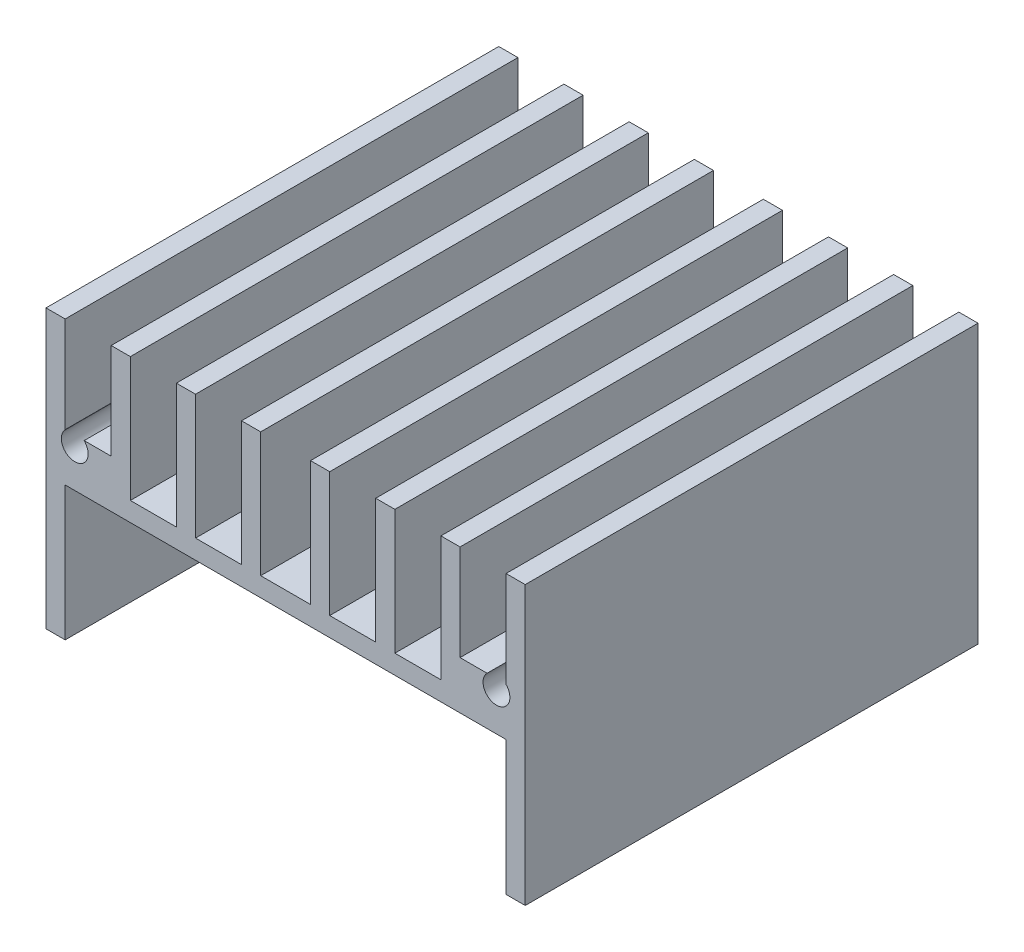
ISO-10303-21;
HEADER;
FILE_DESCRIPTION(('STEP AP214'),'2;1');
FILE_NAME('part.step','',(''),(''),'','','');
FILE_SCHEMA(('AUTOMOTIVE_DESIGN { 1 0 10303 214 1 1 1 1 }'));
ENDSEC;
DATA;
#1=APPLICATION_CONTEXT('core data for automotive mechanical design processes');
#2=APPLICATION_PROTOCOL_DEFINITION('international standard','automotive_design',2000,#1);
#3=PRODUCT_CONTEXT('',#1,'mechanical');
#4=PRODUCT('Part','Part','',(#3));
#5=PRODUCT_RELATED_PRODUCT_CATEGORY('part','',(#4));
#6=PRODUCT_DEFINITION_FORMATION('','',#4);
#7=PRODUCT_DEFINITION_CONTEXT('part definition',#1,'design');
#8=PRODUCT_DEFINITION('design','',#6,#7);
#9=PRODUCT_DEFINITION_SHAPE('','',#8);
#10=(LENGTH_UNIT() NAMED_UNIT(*) SI_UNIT(.MILLI.,.METRE.));
#11=(NAMED_UNIT(*) PLANE_ANGLE_UNIT() SI_UNIT($,.RADIAN.));
#12=(NAMED_UNIT(*) SI_UNIT($,.STERADIAN.) SOLID_ANGLE_UNIT());
#13=UNCERTAINTY_MEASURE_WITH_UNIT(LENGTH_MEASURE(1.E-05),#10,'distance_accuracy_value','');
#14=(GEOMETRIC_REPRESENTATION_CONTEXT(3) GLOBAL_UNCERTAINTY_ASSIGNED_CONTEXT((#13)) GLOBAL_UNIT_ASSIGNED_CONTEXT((#10,
#11,#12)) REPRESENTATION_CONTEXT('',''));
#15=CARTESIAN_POINT('',(0.,0.,0.));
#16=DIRECTION('',(0.,0.,1.));
#17=DIRECTION('',(1.,0.,0.));
#18=AXIS2_PLACEMENT_3D('',#15,#16,#17);
#19=CARTESIAN_POINT('',(11.557,0.635,29.9974));
#20=DIRECTION('',(0.,1.,0.));
#21=DIRECTION('',(0.,0.,1.));
#22=AXIS2_PLACEMENT_3D('',#19,#20,#21);
#23=PLANE('',#22);
#24=DIRECTION('',(0.,0.,-1.));
#25=VECTOR('',#24,1.);
#26=CARTESIAN_POINT('',(14.5921703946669,0.635,32.5118717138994));
#27=LINE('',#26,#25);
#28=CARTESIAN_POINT('',(14.5921703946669,0.635,29.9974));
#29=VERTEX_POINT('',#28);
#30=CARTESIAN_POINT('',(14.5921703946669,0.635,0.));
#31=VERTEX_POINT('',#30);
#32=EDGE_CURVE('E11',#29,#31,#27,.T.);
#33=ORIENTED_EDGE('',*,*,#32,.F.);
#34=DIRECTION('',(1.,0.,0.));
#35=VECTOR('',#34,1.);
#36=CARTESIAN_POINT('',(11.557,0.635,29.9974));
#37=LINE('',#36,#35);
#38=CARTESIAN_POINT('',(14.605,0.635,29.9974));
#39=VERTEX_POINT('',#38);
#40=EDGE_CURVE('E307',#29,#39,#37,.T.);
#41=ORIENTED_EDGE('',*,*,#40,.T.);
#42=DIRECTION('',(0.,0.,-1.));
#43=VECTOR('',#42,1.);
#44=CARTESIAN_POINT('',(14.605,0.635,0.));
#45=LINE('',#44,#43);
#46=CARTESIAN_POINT('',(14.605,0.635,0.));
#47=VERTEX_POINT('',#46);
#48=EDGE_CURVE('E318',#39,#47,#45,.T.);
#49=ORIENTED_EDGE('',*,*,#48,.T.);
#50=DIRECTION('',(-1.,0.,0.));
#51=VECTOR('',#50,1.);
#52=CARTESIAN_POINT('',(11.557,0.635,0.));
#53=LINE('',#52,#51);
#54=EDGE_CURVE('E310',#47,#31,#53,.T.);
#55=ORIENTED_EDGE('',*,*,#54,.T.);
#56=EDGE_LOOP('',(#33,#41,#49,#55));
#57=FACE_BOUND('',#56,.T.);
#58=ADVANCED_FACE('F30',(#57),#23,.T.);
#59=CARTESIAN_POINT('',(-14.605,0.635,29.9974));
#60=DIRECTION('',(0.,1.,0.));
#61=DIRECTION('',(0.,0.,1.));
#62=AXIS2_PLACEMENT_3D('',#59,#60,#61);
#63=PLANE('',#62);
#64=DIRECTION('',(0.,0.,-1.));
#65=VECTOR('',#64,1.);
#66=CARTESIAN_POINT('',(-13.3478296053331,0.635,32.5118717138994));
#67=LINE('',#66,#65);
#68=CARTESIAN_POINT('',(-13.3478296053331,0.635,29.9974));
#69=VERTEX_POINT('',#68);
#70=CARTESIAN_POINT('',(-13.3478296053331,0.635,0.));
#71=VERTEX_POINT('',#70);
#72=EDGE_CURVE('E586',#69,#71,#67,.T.);
#73=ORIENTED_EDGE('',*,*,#72,.F.);
#74=DIRECTION('',(1.,0.,0.));
#75=VECTOR('',#74,1.);
#76=CARTESIAN_POINT('',(-14.605,0.635,29.9974));
#77=LINE('',#76,#75);
#78=CARTESIAN_POINT('',(-11.557,0.635,29.9974));
#79=VERTEX_POINT('',#78);
#80=EDGE_CURVE('E330',#69,#79,#77,.T.);
#81=ORIENTED_EDGE('',*,*,#80,.T.);
#82=DIRECTION('',(0.,0.,-1.));
#83=VECTOR('',#82,1.);
#84=CARTESIAN_POINT('',(-11.557,0.635,0.));
#85=LINE('',#84,#83);
#86=CARTESIAN_POINT('',(-11.557,0.635,0.));
#87=VERTEX_POINT('',#86);
#88=EDGE_CURVE('E334',#79,#87,#85,.T.);
#89=ORIENTED_EDGE('',*,*,#88,.T.);
#90=DIRECTION('',(-1.,0.,0.));
#91=VECTOR('',#90,1.);
#92=CARTESIAN_POINT('',(-14.605,0.635,0.));
#93=LINE('',#92,#91);
#94=EDGE_CURVE('E338',#87,#71,#93,.T.);
#95=ORIENTED_EDGE('',*,*,#94,.T.);
#96=EDGE_LOOP('',(#73,#81,#89,#95));
#97=FACE_BOUND('',#96,.T.);
#98=ADVANCED_FACE('F600',(#97),#63,.T.);
#99=CARTESIAN_POINT('',(-14.605,-11.43,29.9974));
#100=DIRECTION('',(0.,1.,0.));
#101=DIRECTION('',(0.,0.,1.));
#102=AXIS2_PLACEMENT_3D('',#99,#100,#101);
#103=PLANE('',#102);
#104=DIRECTION('',(1.,0.,0.));
#105=VECTOR('',#104,1.);
#106=CARTESIAN_POINT('',(-14.605,-11.43,0.));
#107=LINE('',#106,#105);
#108=CARTESIAN_POINT('',(-15.875,-11.43,0.));
#109=VERTEX_POINT('',#108);
#110=CARTESIAN_POINT('',(-14.605,-11.43,0.));
#111=VERTEX_POINT('',#110);
#112=EDGE_CURVE('E341',#109,#111,#107,.T.);
#113=ORIENTED_EDGE('',*,*,#112,.T.);
#114=DIRECTION('',(0.,0.,-1.));
#115=VECTOR('',#114,1.);
#116=CARTESIAN_POINT('',(-14.605,-11.43,29.9974));
#117=LINE('',#116,#115);
#118=CARTESIAN_POINT('',(-14.605,-11.43,29.9974));
#119=VERTEX_POINT('',#118);
#120=EDGE_CURVE('E578',#119,#111,#117,.T.);
#121=ORIENTED_EDGE('',*,*,#120,.F.);
#122=DIRECTION('',(1.,0.,0.));
#123=VECTOR('',#122,1.);
#124=CARTESIAN_POINT('',(-14.605,-11.43,29.9974));
#125=LINE('',#124,#123);
#126=CARTESIAN_POINT('',(-15.875,-11.43,29.9974));
#127=VERTEX_POINT('',#126);
#128=EDGE_CURVE('E342',#127,#119,#125,.T.);
#129=ORIENTED_EDGE('',*,*,#128,.F.);
#130=DIRECTION('',(0.,0.,-1.));
#131=VECTOR('',#130,1.);
#132=CARTESIAN_POINT('',(-15.875,-11.43,29.9974));
#133=LINE('',#132,#131);
#134=EDGE_CURVE('E412',#127,#109,#133,.T.);
#135=ORIENTED_EDGE('',*,*,#134,.T.);
#136=EDGE_LOOP('',(#113,#121,#129,#135));
#137=FACE_BOUND('',#136,.T.);
#138=ADVANCED_FACE('F32',(#137),#103,.F.);
#139=CARTESIAN_POINT('',(-14.605,-2.54,29.9974));
#140=DIRECTION('',(-1.,0.,0.));
#141=DIRECTION('',(0.,0.,1.));
#142=AXIS2_PLACEMENT_3D('',#139,#140,#141);
#143=PLANE('',#142);
#144=DIRECTION('',(0.,1.,0.));
#145=VECTOR('',#144,1.);
#146=CARTESIAN_POINT('',(-14.605,-2.54,0.));
#147=LINE('',#146,#145);
#148=CARTESIAN_POINT('',(-14.605,-2.54,0.));
#149=VERTEX_POINT('',#148);
#150=EDGE_CURVE('E415',#111,#149,#147,.T.);
#151=ORIENTED_EDGE('',*,*,#150,.T.);
#152=DIRECTION('',(0.,0.,-1.));
#153=VECTOR('',#152,1.);
#154=CARTESIAN_POINT('',(-14.605,-2.54,29.9974));
#155=LINE('',#154,#153);
#156=CARTESIAN_POINT('',(-14.605,-2.54,29.9974));
#157=VERTEX_POINT('',#156);
#158=EDGE_CURVE('E575',#157,#149,#155,.T.);
#159=ORIENTED_EDGE('',*,*,#158,.F.);
#160=DIRECTION('',(0.,1.,0.));
#161=VECTOR('',#160,1.);
#162=CARTESIAN_POINT('',(-14.605,-2.54,29.9974));
#163=LINE('',#162,#161);
#164=EDGE_CURVE('E345',#119,#157,#163,.T.);
#165=ORIENTED_EDGE('',*,*,#164,.F.);
#166=ORIENTED_EDGE('',*,*,#120,.T.);
#167=EDGE_LOOP('',(#151,#159,#165,#166));
#168=FACE_BOUND('',#167,.T.);
#169=ADVANCED_FACE('F754',(#168),#143,.F.);
#170=CARTESIAN_POINT('',(14.605,-2.54,29.9974));
#171=DIRECTION('',(0.,1.,0.));
#172=DIRECTION('',(0.,0.,1.));
#173=AXIS2_PLACEMENT_3D('',#170,#171,#172);
#174=PLANE('',#173);
#175=CARTESIAN_POINT('',(8.89,-2.54,19.9898));
#176=DIRECTION('',(0.,-1.,0.));
#177=DIRECTION('',(0.,0.,-1.));
#178=AXIS2_PLACEMENT_3D('',#175,#176,#177);
#179=CIRCLE('',#178,1.4986);
#180=CARTESIAN_POINT('',(8.89,-2.54,18.4912));
#181=VERTEX_POINT('',#180);
#182=EDGE_CURVE('E732',#181,#181,#179,.T.);
#183=ORIENTED_EDGE('',*,*,#182,.F.);
#184=EDGE_LOOP('',(#183));
#185=FACE_BOUND('',#184,.T.);
#186=CARTESIAN_POINT('',(-8.89,-2.54,19.9898));
#187=DIRECTION('',(0.,-1.,0.));
#188=DIRECTION('',(0.,0.,-1.));
#189=AXIS2_PLACEMENT_3D('',#186,#187,#188);
#190=CIRCLE('',#189,1.4986);
#191=CARTESIAN_POINT('',(-8.89,-2.54,18.4912));
#192=VERTEX_POINT('',#191);
#193=EDGE_CURVE('E731',#192,#192,#190,.T.);
#194=ORIENTED_EDGE('',*,*,#193,.F.);
#195=EDGE_LOOP('',(#194));
#196=FACE_BOUND('',#195,.T.);
#197=DIRECTION('',(1.,0.,0.));
#198=VECTOR('',#197,1.);
#199=CARTESIAN_POINT('',(14.605,-2.54,0.));
#200=LINE('',#199,#198);
#201=CARTESIAN_POINT('',(14.605,-2.54,0.));
#202=VERTEX_POINT('',#201);
#203=EDGE_CURVE('E417',#149,#202,#200,.T.);
#204=ORIENTED_EDGE('',*,*,#203,.T.);
#205=DIRECTION('',(0.,0.,-1.));
#206=VECTOR('',#205,1.);
#207=CARTESIAN_POINT('',(14.605,-2.54,29.9974));
#208=LINE('',#207,#206);
#209=CARTESIAN_POINT('',(14.605,-2.54,29.9974));
#210=VERTEX_POINT('',#209);
#211=EDGE_CURVE('E572',#210,#202,#208,.T.);
#212=ORIENTED_EDGE('',*,*,#211,.F.);
#213=DIRECTION('',(1.,0.,0.));
#214=VECTOR('',#213,1.);
#215=CARTESIAN_POINT('',(14.605,-2.54,29.9974));
#216=LINE('',#215,#214);
#217=EDGE_CURVE('E348',#157,#210,#216,.T.);
#218=ORIENTED_EDGE('',*,*,#217,.F.);
#219=ORIENTED_EDGE('',*,*,#158,.T.);
#220=EDGE_LOOP('',(#204,#212,#218,#219));
#221=FACE_BOUND('',#220,.T.);
#222=ADVANCED_FACE('F750',(#185,#196,#221),#174,.F.);
#223=CARTESIAN_POINT('',(14.605,-11.43,29.9974));
#224=DIRECTION('',(1.,0.,0.));
#225=DIRECTION('',(0.,0.,-1.));
#226=AXIS2_PLACEMENT_3D('',#223,#224,#225);
#227=PLANE('',#226);
#228=DIRECTION('',(0.,-1.,0.));
#229=VECTOR('',#228,1.);
#230=CARTESIAN_POINT('',(14.605,-11.43,0.));
#231=LINE('',#230,#229);
#232=CARTESIAN_POINT('',(14.605,-11.43,0.));
#233=VERTEX_POINT('',#232);
#234=EDGE_CURVE('E419',#202,#233,#231,.T.);
#235=ORIENTED_EDGE('',*,*,#234,.T.);
#236=DIRECTION('',(0.,0.,-1.));
#237=VECTOR('',#236,1.);
#238=CARTESIAN_POINT('',(14.605,-11.43,29.9974));
#239=LINE('',#238,#237);
#240=CARTESIAN_POINT('',(14.605,-11.43,29.9974));
#241=VERTEX_POINT('',#240);
#242=EDGE_CURVE('E569',#241,#233,#239,.T.);
#243=ORIENTED_EDGE('',*,*,#242,.F.);
#244=DIRECTION('',(0.,-1.,0.));
#245=VECTOR('',#244,1.);
#246=CARTESIAN_POINT('',(14.605,-11.43,29.9974));
#247=LINE('',#246,#245);
#248=EDGE_CURVE('E350',#210,#241,#247,.T.);
#249=ORIENTED_EDGE('',*,*,#248,.F.);
#250=ORIENTED_EDGE('',*,*,#211,.T.);
#251=EDGE_LOOP('',(#235,#243,#249,#250));
#252=FACE_BOUND('',#251,.T.);
#253=ADVANCED_FACE('F753',(#252),#227,.F.);
#254=CARTESIAN_POINT('',(15.875,-11.43,29.9974));
#255=DIRECTION('',(0.,1.,0.));
#256=DIRECTION('',(0.,0.,1.));
#257=AXIS2_PLACEMENT_3D('',#254,#255,#256);
#258=PLANE('',#257);
#259=DIRECTION('',(1.,0.,0.));
#260=VECTOR('',#259,1.);
#261=CARTESIAN_POINT('',(15.875,-11.43,0.));
#262=LINE('',#261,#260);
#263=CARTESIAN_POINT('',(15.875,-11.43,0.));
#264=VERTEX_POINT('',#263);
#265=EDGE_CURVE('E421',#233,#264,#262,.T.);
#266=ORIENTED_EDGE('',*,*,#265,.T.);
#267=DIRECTION('',(0.,0.,-1.));
#268=VECTOR('',#267,1.);
#269=CARTESIAN_POINT('',(15.875,-11.43,29.9974));
#270=LINE('',#269,#268);
#271=CARTESIAN_POINT('',(15.875,-11.43,29.9974));
#272=VERTEX_POINT('',#271);
#273=EDGE_CURVE('E566',#272,#264,#270,.T.);
#274=ORIENTED_EDGE('',*,*,#273,.F.);
#275=DIRECTION('',(1.,0.,0.));
#276=VECTOR('',#275,1.);
#277=CARTESIAN_POINT('',(15.875,-11.43,29.9974));
#278=LINE('',#277,#276);
#279=EDGE_CURVE('E352',#241,#272,#278,.T.);
#280=ORIENTED_EDGE('',*,*,#279,.F.);
#281=ORIENTED_EDGE('',*,*,#242,.T.);
#282=EDGE_LOOP('',(#266,#274,#280,#281));
#283=FACE_BOUND('',#282,.T.);
#284=ADVANCED_FACE('F770',(#283),#258,.F.);
#285=CARTESIAN_POINT('',(15.875,6.985,29.9974));
#286=DIRECTION('',(-1.,0.,0.));
#287=DIRECTION('',(0.,0.,1.));
#288=AXIS2_PLACEMENT_3D('',#285,#286,#287);
#289=PLANE('',#288);
#290=DIRECTION('',(0.,1.,0.));
#291=VECTOR('',#290,1.);
#292=CARTESIAN_POINT('',(15.875,6.985,0.));
#293=LINE('',#292,#291);
#294=CARTESIAN_POINT('',(15.875,6.985,0.));
#295=VERTEX_POINT('',#294);
#296=EDGE_CURVE('E423',#264,#295,#293,.T.);
#297=ORIENTED_EDGE('',*,*,#296,.T.);
#298=DIRECTION('',(0.,0.,-1.));
#299=VECTOR('',#298,1.);
#300=CARTESIAN_POINT('',(15.875,6.985,29.9974));
#301=LINE('',#300,#299);
#302=CARTESIAN_POINT('',(15.875,6.985,29.9974));
#303=VERTEX_POINT('',#302);
#304=EDGE_CURVE('E563',#303,#295,#301,.T.);
#305=ORIENTED_EDGE('',*,*,#304,.F.);
#306=DIRECTION('',(0.,1.,0.));
#307=VECTOR('',#306,1.);
#308=CARTESIAN_POINT('',(15.875,6.985,29.9974));
#309=LINE('',#308,#307);
#310=EDGE_CURVE('E354',#272,#303,#309,.T.);
#311=ORIENTED_EDGE('',*,*,#310,.F.);
#312=ORIENTED_EDGE('',*,*,#273,.T.);
#313=EDGE_LOOP('',(#297,#305,#311,#312));
#314=FACE_BOUND('',#313,.T.);
#315=ADVANCED_FACE('F774',(#314),#289,.F.);
#316=CARTESIAN_POINT('',(14.605,6.985,29.9974));
#317=DIRECTION('',(0.,-1.,0.));
#318=DIRECTION('',(0.,0.,-1.));
#319=AXIS2_PLACEMENT_3D('',#316,#317,#318);
#320=PLANE('',#319);
#321=DIRECTION('',(-1.,0.,0.));
#322=VECTOR('',#321,1.);
#323=CARTESIAN_POINT('',(14.605,6.985,0.));
#324=LINE('',#323,#322);
#325=CARTESIAN_POINT('',(14.605,6.985,0.));
#326=VERTEX_POINT('',#325);
#327=EDGE_CURVE('E425',#295,#326,#324,.T.);
#328=ORIENTED_EDGE('',*,*,#327,.T.);
#329=DIRECTION('',(0.,0.,-1.));
#330=VECTOR('',#329,1.);
#331=CARTESIAN_POINT('',(14.605,6.985,29.9974));
#332=LINE('',#331,#330);
#333=CARTESIAN_POINT('',(14.605,6.985,29.9974));
#334=VERTEX_POINT('',#333);
#335=EDGE_CURVE('E560',#334,#326,#332,.T.);
#336=ORIENTED_EDGE('',*,*,#335,.F.);
#337=DIRECTION('',(-1.,0.,0.));
#338=VECTOR('',#337,1.);
#339=CARTESIAN_POINT('',(14.605,6.985,29.9974));
#340=LINE('',#339,#338);
#341=EDGE_CURVE('E356',#303,#334,#340,.T.);
#342=ORIENTED_EDGE('',*,*,#341,.F.);
#343=ORIENTED_EDGE('',*,*,#304,.T.);
#344=EDGE_LOOP('',(#328,#336,#342,#343));
#345=FACE_BOUND('',#344,.T.);
#346=ADVANCED_FACE('F922',(#345),#320,.F.);
#347=CARTESIAN_POINT('',(14.605,-1.27,29.9974));
#348=DIRECTION('',(1.,0.,0.));
#349=DIRECTION('',(0.,0.,-1.));
#350=AXIS2_PLACEMENT_3D('',#347,#348,#349);
#351=PLANE('',#350);
#352=DIRECTION('',(0.,-1.,0.));
#353=VECTOR('',#352,1.);
#354=CARTESIAN_POINT('',(14.605,-1.27,0.));
#355=LINE('',#354,#353);
#356=EDGE_CURVE('E427',#326,#47,#355,.T.);
#357=ORIENTED_EDGE('',*,*,#356,.T.);
#358=ORIENTED_EDGE('',*,*,#48,.F.);
#359=DIRECTION('',(0.,-1.,0.));
#360=VECTOR('',#359,1.);
#361=CARTESIAN_POINT('',(14.605,-1.27,29.9974));
#362=LINE('',#361,#360);
#363=EDGE_CURVE('E314',#334,#39,#362,.T.);
#364=ORIENTED_EDGE('',*,*,#363,.F.);
#365=ORIENTED_EDGE('',*,*,#335,.T.);
#366=EDGE_LOOP('',(#357,#358,#364,#365));
#367=FACE_BOUND('',#366,.T.);
#368=ADVANCED_FACE('F929',(#367),#351,.F.);
#369=CARTESIAN_POINT('',(11.557,6.985,29.9974));
#370=DIRECTION('',(-1.,0.,0.));
#371=DIRECTION('',(0.,0.,1.));
#372=AXIS2_PLACEMENT_3D('',#369,#370,#371);
#373=PLANE('',#372);
#374=DIRECTION('',(0.,1.,0.));
#375=VECTOR('',#374,1.);
#376=CARTESIAN_POINT('',(11.557,6.985,29.9974));
#377=LINE('',#376,#375);
#378=CARTESIAN_POINT('',(11.557,0.635,29.9974));
#379=VERTEX_POINT('',#378);
#380=CARTESIAN_POINT('',(11.557,6.985,29.9974));
#381=VERTEX_POINT('',#380);
#382=EDGE_CURVE('E359',#379,#381,#377,.T.);
#383=ORIENTED_EDGE('',*,*,#382,.F.);
#384=DIRECTION('',(0.,0.,1.));
#385=VECTOR('',#384,1.);
#386=CARTESIAN_POINT('',(11.557,0.635,0.));
#387=LINE('',#386,#385);
#388=CARTESIAN_POINT('',(11.557,0.635,0.));
#389=VERTEX_POINT('',#388);
#390=EDGE_CURVE('E316',#389,#379,#387,.T.);
#391=ORIENTED_EDGE('',*,*,#390,.F.);
#392=DIRECTION('',(0.,1.,0.));
#393=VECTOR('',#392,1.);
#394=CARTESIAN_POINT('',(11.557,6.985,0.));
#395=LINE('',#394,#393);
#396=CARTESIAN_POINT('',(11.557,6.985,0.));
#397=VERTEX_POINT('',#396);
#398=EDGE_CURVE('E429',#389,#397,#395,.T.);
#399=ORIENTED_EDGE('',*,*,#398,.T.);
#400=DIRECTION('',(0.,0.,-1.));
#401=VECTOR('',#400,1.);
#402=CARTESIAN_POINT('',(11.557,6.985,29.9974));
#403=LINE('',#402,#401);
#404=EDGE_CURVE('E557',#381,#397,#403,.T.);
#405=ORIENTED_EDGE('',*,*,#404,.F.);
#406=EDGE_LOOP('',(#383,#391,#399,#405));
#407=FACE_BOUND('',#406,.T.);
#408=ADVANCED_FACE('F718',(#407),#373,.F.);
#409=CARTESIAN_POINT('',(10.287,6.985,29.9974));
#410=DIRECTION('',(0.,-1.,0.));
#411=DIRECTION('',(0.,0.,-1.));
#412=AXIS2_PLACEMENT_3D('',#409,#410,#411);
#413=PLANE('',#412);
#414=DIRECTION('',(-1.,0.,0.));
#415=VECTOR('',#414,1.);
#416=CARTESIAN_POINT('',(10.287,6.985,0.));
#417=LINE('',#416,#415);
#418=CARTESIAN_POINT('',(10.287,6.985,0.));
#419=VERTEX_POINT('',#418);
#420=EDGE_CURVE('E431',#397,#419,#417,.T.);
#421=ORIENTED_EDGE('',*,*,#420,.T.);
#422=DIRECTION('',(0.,0.,-1.));
#423=VECTOR('',#422,1.);
#424=CARTESIAN_POINT('',(10.287,6.985,29.9974));
#425=LINE('',#424,#423);
#426=CARTESIAN_POINT('',(10.287,6.985,29.9974));
#427=VERTEX_POINT('',#426);
#428=EDGE_CURVE('E553',#427,#419,#425,.T.);
#429=ORIENTED_EDGE('',*,*,#428,.F.);
#430=DIRECTION('',(-1.,0.,0.));
#431=VECTOR('',#430,1.);
#432=CARTESIAN_POINT('',(10.287,6.985,29.9974));
#433=LINE('',#432,#431);
#434=EDGE_CURVE('E361',#381,#427,#433,.T.);
#435=ORIENTED_EDGE('',*,*,#434,.F.);
#436=ORIENTED_EDGE('',*,*,#404,.T.);
#437=EDGE_LOOP('',(#421,#429,#435,#436));
#438=FACE_BOUND('',#437,.T.);
#439=ADVANCED_FACE('F715',(#438),#413,.F.);
#440=CARTESIAN_POINT('',(10.287,-1.27,29.9974));
#441=DIRECTION('',(1.,0.,0.));
#442=DIRECTION('',(0.,0.,-1.));
#443=AXIS2_PLACEMENT_3D('',#440,#441,#442);
#444=PLANE('',#443);
#445=DIRECTION('',(0.,-1.,0.));
#446=VECTOR('',#445,1.);
#447=CARTESIAN_POINT('',(10.287,-1.27,0.));
#448=LINE('',#447,#446);
#449=CARTESIAN_POINT('',(10.287,-1.27,0.));
#450=VERTEX_POINT('',#449);
#451=EDGE_CURVE('E433',#419,#450,#448,.T.);
#452=ORIENTED_EDGE('',*,*,#451,.T.);
#453=DIRECTION('',(0.,0.,-1.));
#454=VECTOR('',#453,1.);
#455=CARTESIAN_POINT('',(10.287,-1.27,29.9974));
#456=LINE('',#455,#454);
#457=CARTESIAN_POINT('',(10.287,-1.27,19.4474044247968));
#458=VERTEX_POINT('',#457);
#459=EDGE_CURVE('E549',#458,#450,#456,.T.);
#460=ORIENTED_EDGE('',*,*,#459,.F.);
#461=CARTESIAN_POINT('',(10.287,-1.27,20.5321955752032));
#462=VERTEX_POINT('',#461);
#463=EDGE_CURVE('E554',#462,#458,#456,.T.);
#464=ORIENTED_EDGE('',*,*,#463,.F.);
#465=CARTESIAN_POINT('',(10.287,-1.27,29.9974));
#466=VERTEX_POINT('',#465);
#467=EDGE_CURVE('E550',#466,#462,#456,.T.);
#468=ORIENTED_EDGE('',*,*,#467,.F.);
#469=DIRECTION('',(0.,-1.,0.));
#470=VECTOR('',#469,1.);
#471=CARTESIAN_POINT('',(10.287,-1.27,29.9974));
#472=LINE('',#471,#470);
#473=EDGE_CURVE('E363',#427,#466,#472,.T.);
#474=ORIENTED_EDGE('',*,*,#473,.F.);
#475=ORIENTED_EDGE('',*,*,#428,.T.);
#476=EDGE_LOOP('',(#452,#460,#464,#468,#474,#475));
#477=FACE_BOUND('',#476,.T.);
#478=ADVANCED_FACE('F708',(#477),#444,.F.);
#479=CARTESIAN_POINT('',(7.239,-1.27,29.9974));
#480=DIRECTION('',(0.,-1.,0.));
#481=DIRECTION('',(0.,0.,-1.));
#482=AXIS2_PLACEMENT_3D('',#479,#480,#481);
#483=PLANE('',#482);
#484=ORIENTED_EDGE('',*,*,#467,.T.);
#485=CARTESIAN_POINT('',(8.89,-1.27,19.9898));
#486=DIRECTION('',(0.,-1.,0.));
#487=DIRECTION('',(0.,0.,-1.));
#488=AXIS2_PLACEMENT_3D('',#485,#486,#487);
#489=CIRCLE('',#488,1.4986);
#490=EDGE_CURVE('E581',#462,#458,#489,.T.);
#491=ORIENTED_EDGE('',*,*,#490,.T.);
#492=ORIENTED_EDGE('',*,*,#459,.T.);
#493=DIRECTION('',(-1.,0.,0.));
#494=VECTOR('',#493,1.);
#495=CARTESIAN_POINT('',(7.239,-1.27,0.));
#496=LINE('',#495,#494);
#497=CARTESIAN_POINT('',(7.239,-1.27,0.));
#498=VERTEX_POINT('',#497);
#499=EDGE_CURVE('E436',#450,#498,#496,.T.);
#500=ORIENTED_EDGE('',*,*,#499,.T.);
#501=DIRECTION('',(0.,0.,-1.));
#502=VECTOR('',#501,1.);
#503=CARTESIAN_POINT('',(7.239,-1.27,29.9974));
#504=LINE('',#503,#502);
#505=CARTESIAN_POINT('',(7.239,-1.27,29.9974));
#506=VERTEX_POINT('',#505);
#507=EDGE_CURVE('E546',#506,#498,#504,.T.);
#508=ORIENTED_EDGE('',*,*,#507,.F.);
#509=DIRECTION('',(-1.,0.,0.));
#510=VECTOR('',#509,1.);
#511=CARTESIAN_POINT('',(7.239,-1.27,29.9974));
#512=LINE('',#511,#510);
#513=EDGE_CURVE('E365',#466,#506,#512,.T.);
#514=ORIENTED_EDGE('',*,*,#513,.F.);
#515=EDGE_LOOP('',(#484,#491,#492,#500,#508,#514));
#516=FACE_BOUND('',#515,.T.);
#517=ADVANCED_FACE('F702',(#516),#483,.F.);
#518=CARTESIAN_POINT('',(7.239,6.985,29.9974));
#519=DIRECTION('',(-1.,0.,0.));
#520=DIRECTION('',(0.,0.,1.));
#521=AXIS2_PLACEMENT_3D('',#518,#519,#520);
#522=PLANE('',#521);
#523=DIRECTION('',(0.,1.,0.));
#524=VECTOR('',#523,1.);
#525=CARTESIAN_POINT('',(7.239,6.985,0.));
#526=LINE('',#525,#524);
#527=CARTESIAN_POINT('',(7.239,6.985,0.));
#528=VERTEX_POINT('',#527);
#529=EDGE_CURVE('E438',#498,#528,#526,.T.);
#530=ORIENTED_EDGE('',*,*,#529,.T.);
#531=DIRECTION('',(0.,0.,-1.));
#532=VECTOR('',#531,1.);
#533=CARTESIAN_POINT('',(7.239,6.985,29.9974));
#534=LINE('',#533,#532);
#535=CARTESIAN_POINT('',(7.239,6.985,29.9974));
#536=VERTEX_POINT('',#535);
#537=EDGE_CURVE('E543',#536,#528,#534,.T.);
#538=ORIENTED_EDGE('',*,*,#537,.F.);
#539=DIRECTION('',(0.,1.,0.));
#540=VECTOR('',#539,1.);
#541=CARTESIAN_POINT('',(7.239,6.985,29.9974));
#542=LINE('',#541,#540);
#543=EDGE_CURVE('E367',#506,#536,#542,.T.);
#544=ORIENTED_EDGE('',*,*,#543,.F.);
#545=ORIENTED_EDGE('',*,*,#507,.T.);
#546=EDGE_LOOP('',(#530,#538,#544,#545));
#547=FACE_BOUND('',#546,.T.);
#548=ADVANCED_FACE('F698',(#547),#522,.F.);
#549=CARTESIAN_POINT('',(5.969,6.985,29.9974));
#550=DIRECTION('',(0.,-1.,0.));
#551=DIRECTION('',(0.,0.,-1.));
#552=AXIS2_PLACEMENT_3D('',#549,#550,#551);
#553=PLANE('',#552);
#554=DIRECTION('',(-1.,0.,0.));
#555=VECTOR('',#554,1.);
#556=CARTESIAN_POINT('',(5.969,6.985,0.));
#557=LINE('',#556,#555);
#558=CARTESIAN_POINT('',(5.969,6.985,0.));
#559=VERTEX_POINT('',#558);
#560=EDGE_CURVE('E440',#528,#559,#557,.T.);
#561=ORIENTED_EDGE('',*,*,#560,.T.);
#562=DIRECTION('',(0.,0.,-1.));
#563=VECTOR('',#562,1.);
#564=CARTESIAN_POINT('',(5.969,6.985,29.9974));
#565=LINE('',#564,#563);
#566=CARTESIAN_POINT('',(5.969,6.985,29.9974));
#567=VERTEX_POINT('',#566);
#568=EDGE_CURVE('E540',#567,#559,#565,.T.);
#569=ORIENTED_EDGE('',*,*,#568,.F.);
#570=DIRECTION('',(-1.,0.,0.));
#571=VECTOR('',#570,1.);
#572=CARTESIAN_POINT('',(5.969,6.985,29.9974));
#573=LINE('',#572,#571);
#574=EDGE_CURVE('E369',#536,#567,#573,.T.);
#575=ORIENTED_EDGE('',*,*,#574,.F.);
#576=ORIENTED_EDGE('',*,*,#537,.T.);
#577=EDGE_LOOP('',(#561,#569,#575,#576));
#578=FACE_BOUND('',#577,.T.);
#579=ADVANCED_FACE('F693',(#578),#553,.F.);
#580=CARTESIAN_POINT('',(5.969,-1.27,29.9974));
#581=DIRECTION('',(1.,0.,0.));
#582=DIRECTION('',(0.,0.,-1.));
#583=AXIS2_PLACEMENT_3D('',#580,#581,#582);
#584=PLANE('',#583);
#585=DIRECTION('',(0.,-1.,0.));
#586=VECTOR('',#585,1.);
#587=CARTESIAN_POINT('',(5.969,-1.27,0.));
#588=LINE('',#587,#586);
#589=CARTESIAN_POINT('',(5.969,-1.27,0.));
#590=VERTEX_POINT('',#589);
#591=EDGE_CURVE('E442',#559,#590,#588,.T.);
#592=ORIENTED_EDGE('',*,*,#591,.T.);
#593=DIRECTION('',(0.,0.,-1.));
#594=VECTOR('',#593,1.);
#595=CARTESIAN_POINT('',(5.969,-1.27,29.9974));
#596=LINE('',#595,#594);
#597=CARTESIAN_POINT('',(5.969,-1.27,29.9974));
#598=VERTEX_POINT('',#597);
#599=EDGE_CURVE('E537',#598,#590,#596,.T.);
#600=ORIENTED_EDGE('',*,*,#599,.F.);
#601=DIRECTION('',(0.,-1.,0.));
#602=VECTOR('',#601,1.);
#603=CARTESIAN_POINT('',(5.969,-1.27,29.9974));
#604=LINE('',#603,#602);
#605=EDGE_CURVE('E371',#567,#598,#604,.T.);
#606=ORIENTED_EDGE('',*,*,#605,.F.);
#607=ORIENTED_EDGE('',*,*,#568,.T.);
#608=EDGE_LOOP('',(#592,#600,#606,#607));
#609=FACE_BOUND('',#608,.T.);
#610=ADVANCED_FACE('F687',(#609),#584,.F.);
#611=CARTESIAN_POINT('',(2.921,-1.27,29.9974));
#612=DIRECTION('',(0.,-1.,0.));
#613=DIRECTION('',(0.,0.,-1.));
#614=AXIS2_PLACEMENT_3D('',#611,#612,#613);
#615=PLANE('',#614);
#616=DIRECTION('',(-1.,0.,0.));
#617=VECTOR('',#616,1.);
#618=CARTESIAN_POINT('',(2.921,-1.27,0.));
#619=LINE('',#618,#617);
#620=CARTESIAN_POINT('',(2.921,-1.27,0.));
#621=VERTEX_POINT('',#620);
#622=EDGE_CURVE('E444',#590,#621,#619,.T.);
#623=ORIENTED_EDGE('',*,*,#622,.T.);
#624=DIRECTION('',(0.,0.,-1.));
#625=VECTOR('',#624,1.);
#626=CARTESIAN_POINT('',(2.921,-1.27,29.9974));
#627=LINE('',#626,#625);
#628=CARTESIAN_POINT('',(2.921,-1.27,29.9974));
#629=VERTEX_POINT('',#628);
#630=EDGE_CURVE('E534',#629,#621,#627,.T.);
#631=ORIENTED_EDGE('',*,*,#630,.F.);
#632=DIRECTION('',(-1.,0.,0.));
#633=VECTOR('',#632,1.);
#634=CARTESIAN_POINT('',(2.921,-1.27,29.9974));
#635=LINE('',#634,#633);
#636=EDGE_CURVE('E373',#598,#629,#635,.T.);
#637=ORIENTED_EDGE('',*,*,#636,.F.);
#638=ORIENTED_EDGE('',*,*,#599,.T.);
#639=EDGE_LOOP('',(#623,#631,#637,#638));
#640=FACE_BOUND('',#639,.T.);
#641=ADVANCED_FACE('F683',(#640),#615,.F.);
#642=CARTESIAN_POINT('',(2.921,6.985,29.9974));
#643=DIRECTION('',(-1.,0.,0.));
#644=DIRECTION('',(0.,0.,1.));
#645=AXIS2_PLACEMENT_3D('',#642,#643,#644);
#646=PLANE('',#645);
#647=DIRECTION('',(0.,1.,0.));
#648=VECTOR('',#647,1.);
#649=CARTESIAN_POINT('',(2.921,6.985,0.));
#650=LINE('',#649,#648);
#651=CARTESIAN_POINT('',(2.921,6.985,0.));
#652=VERTEX_POINT('',#651);
#653=EDGE_CURVE('E446',#621,#652,#650,.T.);
#654=ORIENTED_EDGE('',*,*,#653,.T.);
#655=DIRECTION('',(0.,0.,-1.));
#656=VECTOR('',#655,1.);
#657=CARTESIAN_POINT('',(2.921,6.985,29.9974));
#658=LINE('',#657,#656);
#659=CARTESIAN_POINT('',(2.921,6.985,29.9974));
#660=VERTEX_POINT('',#659);
#661=EDGE_CURVE('E531',#660,#652,#658,.T.);
#662=ORIENTED_EDGE('',*,*,#661,.F.);
#663=DIRECTION('',(0.,1.,0.));
#664=VECTOR('',#663,1.);
#665=CARTESIAN_POINT('',(2.921,6.985,29.9974));
#666=LINE('',#665,#664);
#667=EDGE_CURVE('E375',#629,#660,#666,.T.);
#668=ORIENTED_EDGE('',*,*,#667,.F.);
#669=ORIENTED_EDGE('',*,*,#630,.T.);
#670=EDGE_LOOP('',(#654,#662,#668,#669));
#671=FACE_BOUND('',#670,.T.);
#672=ADVANCED_FACE('F678',(#671),#646,.F.);
#673=CARTESIAN_POINT('',(1.651,6.985,29.9974));
#674=DIRECTION('',(0.,-1.,0.));
#675=DIRECTION('',(0.,0.,-1.));
#676=AXIS2_PLACEMENT_3D('',#673,#674,#675);
#677=PLANE('',#676);
#678=DIRECTION('',(-1.,0.,0.));
#679=VECTOR('',#678,1.);
#680=CARTESIAN_POINT('',(1.651,6.985,0.));
#681=LINE('',#680,#679);
#682=CARTESIAN_POINT('',(1.651,6.985,0.));
#683=VERTEX_POINT('',#682);
#684=EDGE_CURVE('E448',#652,#683,#681,.T.);
#685=ORIENTED_EDGE('',*,*,#684,.T.);
#686=DIRECTION('',(0.,0.,-1.));
#687=VECTOR('',#686,1.);
#688=CARTESIAN_POINT('',(1.651,6.985,29.9974));
#689=LINE('',#688,#687);
#690=CARTESIAN_POINT('',(1.651,6.985,29.9974));
#691=VERTEX_POINT('',#690);
#692=EDGE_CURVE('E528',#691,#683,#689,.T.);
#693=ORIENTED_EDGE('',*,*,#692,.F.);
#694=DIRECTION('',(-1.,0.,0.));
#695=VECTOR('',#694,1.);
#696=CARTESIAN_POINT('',(1.651,6.985,29.9974));
#697=LINE('',#696,#695);
#698=EDGE_CURVE('E377',#660,#691,#697,.T.);
#699=ORIENTED_EDGE('',*,*,#698,.F.);
#700=ORIENTED_EDGE('',*,*,#661,.T.);
#701=EDGE_LOOP('',(#685,#693,#699,#700));
#702=FACE_BOUND('',#701,.T.);
#703=ADVANCED_FACE('F672',(#702),#677,.F.);
#704=CARTESIAN_POINT('',(1.651,-1.27,29.9974));
#705=DIRECTION('',(1.,0.,0.));
#706=DIRECTION('',(0.,0.,-1.));
#707=AXIS2_PLACEMENT_3D('',#704,#705,#706);
#708=PLANE('',#707);
#709=DIRECTION('',(0.,-1.,0.));
#710=VECTOR('',#709,1.);
#711=CARTESIAN_POINT('',(1.651,-1.27,0.));
#712=LINE('',#711,#710);
#713=CARTESIAN_POINT('',(1.651,-1.27,0.));
#714=VERTEX_POINT('',#713);
#715=EDGE_CURVE('E450',#683,#714,#712,.T.);
#716=ORIENTED_EDGE('',*,*,#715,.T.);
#717=DIRECTION('',(0.,0.,-1.));
#718=VECTOR('',#717,1.);
#719=CARTESIAN_POINT('',(1.651,-1.27,29.9974));
#720=LINE('',#719,#718);
#721=CARTESIAN_POINT('',(1.651,-1.27,29.9974));
#722=VERTEX_POINT('',#721);
#723=EDGE_CURVE('E525',#722,#714,#720,.T.);
#724=ORIENTED_EDGE('',*,*,#723,.F.);
#725=DIRECTION('',(0.,-1.,0.));
#726=VECTOR('',#725,1.);
#727=CARTESIAN_POINT('',(1.651,-1.27,29.9974));
#728=LINE('',#727,#726);
#729=EDGE_CURVE('E379',#691,#722,#728,.T.);
#730=ORIENTED_EDGE('',*,*,#729,.F.);
#731=ORIENTED_EDGE('',*,*,#692,.T.);
#732=EDGE_LOOP('',(#716,#724,#730,#731));
#733=FACE_BOUND('',#732,.T.);
#734=ADVANCED_FACE('F668',(#733),#708,.F.);
#735=CARTESIAN_POINT('',(-1.651,-1.27,29.9974));
#736=DIRECTION('',(0.,-1.,0.));
#737=DIRECTION('',(0.,0.,-1.));
#738=AXIS2_PLACEMENT_3D('',#735,#736,#737);
#739=PLANE('',#738);
#740=DIRECTION('',(-1.,0.,0.));
#741=VECTOR('',#740,1.);
#742=CARTESIAN_POINT('',(-1.651,-1.27,0.));
#743=LINE('',#742,#741);
#744=CARTESIAN_POINT('',(-1.651,-1.27,0.));
#745=VERTEX_POINT('',#744);
#746=EDGE_CURVE('E452',#714,#745,#743,.T.);
#747=ORIENTED_EDGE('',*,*,#746,.T.);
#748=DIRECTION('',(0.,0.,-1.));
#749=VECTOR('',#748,1.);
#750=CARTESIAN_POINT('',(-1.651,-1.27,29.9974));
#751=LINE('',#750,#749);
#752=CARTESIAN_POINT('',(-1.651,-1.27,29.9974));
#753=VERTEX_POINT('',#752);
#754=EDGE_CURVE('E522',#753,#745,#751,.T.);
#755=ORIENTED_EDGE('',*,*,#754,.F.);
#756=DIRECTION('',(-1.,0.,0.));
#757=VECTOR('',#756,1.);
#758=CARTESIAN_POINT('',(-1.651,-1.27,29.9974));
#759=LINE('',#758,#757);
#760=EDGE_CURVE('E381',#722,#753,#759,.T.);
#761=ORIENTED_EDGE('',*,*,#760,.F.);
#762=ORIENTED_EDGE('',*,*,#723,.T.);
#763=EDGE_LOOP('',(#747,#755,#761,#762));
#764=FACE_BOUND('',#763,.T.);
#765=ADVANCED_FACE('F663',(#764),#739,.F.);
#766=CARTESIAN_POINT('',(-1.651,6.985,29.9974));
#767=DIRECTION('',(-1.,0.,0.));
#768=DIRECTION('',(0.,0.,1.));
#769=AXIS2_PLACEMENT_3D('',#766,#767,#768);
#770=PLANE('',#769);
#771=DIRECTION('',(0.,1.,0.));
#772=VECTOR('',#771,1.);
#773=CARTESIAN_POINT('',(-1.651,6.985,0.));
#774=LINE('',#773,#772);
#775=CARTESIAN_POINT('',(-1.651,6.985,0.));
#776=VERTEX_POINT('',#775);
#777=EDGE_CURVE('E454',#745,#776,#774,.T.);
#778=ORIENTED_EDGE('',*,*,#777,.T.);
#779=DIRECTION('',(0.,0.,-1.));
#780=VECTOR('',#779,1.);
#781=CARTESIAN_POINT('',(-1.651,6.985,29.9974));
#782=LINE('',#781,#780);
#783=CARTESIAN_POINT('',(-1.651,6.985,29.9974));
#784=VERTEX_POINT('',#783);
#785=EDGE_CURVE('E519',#784,#776,#782,.T.);
#786=ORIENTED_EDGE('',*,*,#785,.F.);
#787=DIRECTION('',(0.,1.,0.));
#788=VECTOR('',#787,1.);
#789=CARTESIAN_POINT('',(-1.651,6.985,29.9974));
#790=LINE('',#789,#788);
#791=EDGE_CURVE('E383',#753,#784,#790,.T.);
#792=ORIENTED_EDGE('',*,*,#791,.F.);
#793=ORIENTED_EDGE('',*,*,#754,.T.);
#794=EDGE_LOOP('',(#778,#786,#792,#793));
#795=FACE_BOUND('',#794,.T.);
#796=ADVANCED_FACE('F657',(#795),#770,.F.);
#797=CARTESIAN_POINT('',(-2.921,6.985,29.9974));
#798=DIRECTION('',(0.,-1.,0.));
#799=DIRECTION('',(0.,0.,-1.));
#800=AXIS2_PLACEMENT_3D('',#797,#798,#799);
#801=PLANE('',#800);
#802=DIRECTION('',(-1.,0.,0.));
#803=VECTOR('',#802,1.);
#804=CARTESIAN_POINT('',(-2.921,6.985,0.));
#805=LINE('',#804,#803);
#806=CARTESIAN_POINT('',(-2.921,6.985,0.));
#807=VERTEX_POINT('',#806);
#808=EDGE_CURVE('E456',#776,#807,#805,.T.);
#809=ORIENTED_EDGE('',*,*,#808,.T.);
#810=DIRECTION('',(0.,0.,-1.));
#811=VECTOR('',#810,1.);
#812=CARTESIAN_POINT('',(-2.921,6.985,29.9974));
#813=LINE('',#812,#811);
#814=CARTESIAN_POINT('',(-2.921,6.985,29.9974));
#815=VERTEX_POINT('',#814);
#816=EDGE_CURVE('E516',#815,#807,#813,.T.);
#817=ORIENTED_EDGE('',*,*,#816,.F.);
#818=DIRECTION('',(-1.,0.,0.));
#819=VECTOR('',#818,1.);
#820=CARTESIAN_POINT('',(-2.921,6.985,29.9974));
#821=LINE('',#820,#819);
#822=EDGE_CURVE('E385',#784,#815,#821,.T.);
#823=ORIENTED_EDGE('',*,*,#822,.F.);
#824=ORIENTED_EDGE('',*,*,#785,.T.);
#825=EDGE_LOOP('',(#809,#817,#823,#824));
#826=FACE_BOUND('',#825,.T.);
#827=ADVANCED_FACE('F653',(#826),#801,.F.);
#828=CARTESIAN_POINT('',(-2.921,-1.27,29.9974));
#829=DIRECTION('',(1.,0.,0.));
#830=DIRECTION('',(0.,0.,-1.));
#831=AXIS2_PLACEMENT_3D('',#828,#829,#830);
#832=PLANE('',#831);
#833=DIRECTION('',(0.,-1.,0.));
#834=VECTOR('',#833,1.);
#835=CARTESIAN_POINT('',(-2.921,-1.27,0.));
#836=LINE('',#835,#834);
#837=CARTESIAN_POINT('',(-2.921,-1.27,0.));
#838=VERTEX_POINT('',#837);
#839=EDGE_CURVE('E458',#807,#838,#836,.T.);
#840=ORIENTED_EDGE('',*,*,#839,.T.);
#841=DIRECTION('',(0.,0.,-1.));
#842=VECTOR('',#841,1.);
#843=CARTESIAN_POINT('',(-2.921,-1.27,29.9974));
#844=LINE('',#843,#842);
#845=CARTESIAN_POINT('',(-2.921,-1.27,29.9974));
#846=VERTEX_POINT('',#845);
#847=EDGE_CURVE('E513',#846,#838,#844,.T.);
#848=ORIENTED_EDGE('',*,*,#847,.F.);
#849=DIRECTION('',(0.,-1.,0.));
#850=VECTOR('',#849,1.);
#851=CARTESIAN_POINT('',(-2.921,-1.27,29.9974));
#852=LINE('',#851,#850);
#853=EDGE_CURVE('E387',#815,#846,#852,.T.);
#854=ORIENTED_EDGE('',*,*,#853,.F.);
#855=ORIENTED_EDGE('',*,*,#816,.T.);
#856=EDGE_LOOP('',(#840,#848,#854,#855));
#857=FACE_BOUND('',#856,.T.);
#858=ADVANCED_FACE('F648',(#857),#832,.F.);
#859=CARTESIAN_POINT('',(-5.969,-1.27,29.9974));
#860=DIRECTION('',(0.,-1.,0.));
#861=DIRECTION('',(0.,0.,-1.));
#862=AXIS2_PLACEMENT_3D('',#859,#860,#861);
#863=PLANE('',#862);
#864=DIRECTION('',(-1.,0.,0.));
#865=VECTOR('',#864,1.);
#866=CARTESIAN_POINT('',(-5.969,-1.27,0.));
#867=LINE('',#866,#865);
#868=CARTESIAN_POINT('',(-5.969,-1.27,0.));
#869=VERTEX_POINT('',#868);
#870=EDGE_CURVE('E460',#838,#869,#867,.T.);
#871=ORIENTED_EDGE('',*,*,#870,.T.);
#872=DIRECTION('',(0.,0.,-1.));
#873=VECTOR('',#872,1.);
#874=CARTESIAN_POINT('',(-5.969,-1.27,29.9974));
#875=LINE('',#874,#873);
#876=CARTESIAN_POINT('',(-5.969,-1.27,29.9974));
#877=VERTEX_POINT('',#876);
#878=EDGE_CURVE('E510',#877,#869,#875,.T.);
#879=ORIENTED_EDGE('',*,*,#878,.F.);
#880=DIRECTION('',(-1.,0.,0.));
#881=VECTOR('',#880,1.);
#882=CARTESIAN_POINT('',(-5.969,-1.27,29.9974));
#883=LINE('',#882,#881);
#884=EDGE_CURVE('E389',#846,#877,#883,.T.);
#885=ORIENTED_EDGE('',*,*,#884,.F.);
#886=ORIENTED_EDGE('',*,*,#847,.T.);
#887=EDGE_LOOP('',(#871,#879,#885,#886));
#888=FACE_BOUND('',#887,.T.);
#889=ADVANCED_FACE('F642',(#888),#863,.F.);
#890=CARTESIAN_POINT('',(-5.969,6.985,29.9974));
#891=DIRECTION('',(-1.,0.,0.));
#892=DIRECTION('',(0.,0.,1.));
#893=AXIS2_PLACEMENT_3D('',#890,#891,#892);
#894=PLANE('',#893);
#895=DIRECTION('',(0.,1.,0.));
#896=VECTOR('',#895,1.);
#897=CARTESIAN_POINT('',(-5.969,6.985,0.));
#898=LINE('',#897,#896);
#899=CARTESIAN_POINT('',(-5.969,6.985,0.));
#900=VERTEX_POINT('',#899);
#901=EDGE_CURVE('E462',#869,#900,#898,.T.);
#902=ORIENTED_EDGE('',*,*,#901,.T.);
#903=DIRECTION('',(0.,0.,-1.));
#904=VECTOR('',#903,1.);
#905=CARTESIAN_POINT('',(-5.969,6.985,29.9974));
#906=LINE('',#905,#904);
#907=CARTESIAN_POINT('',(-5.969,6.985,29.9974));
#908=VERTEX_POINT('',#907);
#909=EDGE_CURVE('E507',#908,#900,#906,.T.);
#910=ORIENTED_EDGE('',*,*,#909,.F.);
#911=DIRECTION('',(0.,1.,0.));
#912=VECTOR('',#911,1.);
#913=CARTESIAN_POINT('',(-5.969,6.985,29.9974));
#914=LINE('',#913,#912);
#915=EDGE_CURVE('E391',#877,#908,#914,.T.);
#916=ORIENTED_EDGE('',*,*,#915,.F.);
#917=ORIENTED_EDGE('',*,*,#878,.T.);
#918=EDGE_LOOP('',(#902,#910,#916,#917));
#919=FACE_BOUND('',#918,.T.);
#920=ADVANCED_FACE('F638',(#919),#894,.F.);
#921=CARTESIAN_POINT('',(-7.239,6.985,29.9974));
#922=DIRECTION('',(0.,-1.,0.));
#923=DIRECTION('',(0.,0.,-1.));
#924=AXIS2_PLACEMENT_3D('',#921,#922,#923);
#925=PLANE('',#924);
#926=DIRECTION('',(-1.,0.,0.));
#927=VECTOR('',#926,1.);
#928=CARTESIAN_POINT('',(-7.239,6.985,0.));
#929=LINE('',#928,#927);
#930=CARTESIAN_POINT('',(-7.239,6.985,0.));
#931=VERTEX_POINT('',#930);
#932=EDGE_CURVE('E464',#900,#931,#929,.T.);
#933=ORIENTED_EDGE('',*,*,#932,.T.);
#934=DIRECTION('',(0.,0.,-1.));
#935=VECTOR('',#934,1.);
#936=CARTESIAN_POINT('',(-7.239,6.985,29.9974));
#937=LINE('',#936,#935);
#938=CARTESIAN_POINT('',(-7.239,6.985,29.9974));
#939=VERTEX_POINT('',#938);
#940=EDGE_CURVE('E504',#939,#931,#937,.T.);
#941=ORIENTED_EDGE('',*,*,#940,.F.);
#942=DIRECTION('',(-1.,0.,0.));
#943=VECTOR('',#942,1.);
#944=CARTESIAN_POINT('',(-7.239,6.985,29.9974));
#945=LINE('',#944,#943);
#946=EDGE_CURVE('E393',#908,#939,#945,.T.);
#947=ORIENTED_EDGE('',*,*,#946,.F.);
#948=ORIENTED_EDGE('',*,*,#909,.T.);
#949=EDGE_LOOP('',(#933,#941,#947,#948));
#950=FACE_BOUND('',#949,.T.);
#951=ADVANCED_FACE('F633',(#950),#925,.F.);
#952=CARTESIAN_POINT('',(-7.239,-1.27,29.9974));
#953=DIRECTION('',(1.,0.,0.));
#954=DIRECTION('',(0.,0.,-1.));
#955=AXIS2_PLACEMENT_3D('',#952,#953,#954);
#956=PLANE('',#955);
#957=DIRECTION('',(0.,-1.,0.));
#958=VECTOR('',#957,1.);
#959=CARTESIAN_POINT('',(-7.239,-1.27,0.));
#960=LINE('',#959,#958);
#961=CARTESIAN_POINT('',(-7.239,-1.27,0.));
#962=VERTEX_POINT('',#961);
#963=EDGE_CURVE('E466',#931,#962,#960,.T.);
#964=ORIENTED_EDGE('',*,*,#963,.T.);
#965=DIRECTION('',(0.,0.,-1.));
#966=VECTOR('',#965,1.);
#967=CARTESIAN_POINT('',(-7.239,-1.27,29.9974));
#968=LINE('',#967,#966);
#969=CARTESIAN_POINT('',(-7.239,-1.27,29.9974));
#970=VERTEX_POINT('',#969);
#971=EDGE_CURVE('E500',#970,#962,#968,.T.);
#972=ORIENTED_EDGE('',*,*,#971,.F.);
#973=DIRECTION('',(0.,-1.,0.));
#974=VECTOR('',#973,1.);
#975=CARTESIAN_POINT('',(-7.239,-1.27,29.9974));
#976=LINE('',#975,#974);
#977=EDGE_CURVE('E395',#939,#970,#976,.T.);
#978=ORIENTED_EDGE('',*,*,#977,.F.);
#979=ORIENTED_EDGE('',*,*,#940,.T.);
#980=EDGE_LOOP('',(#964,#972,#978,#979));
#981=FACE_BOUND('',#980,.T.);
#982=ADVANCED_FACE('F627',(#981),#956,.F.);
#983=CARTESIAN_POINT('',(-10.287,-1.27,29.9974));
#984=DIRECTION('',(0.,-1.,0.));
#985=DIRECTION('',(0.,0.,-1.));
#986=AXIS2_PLACEMENT_3D('',#983,#984,#985);
#987=PLANE('',#986);
#988=DIRECTION('',(0.,0.,-1.));
#989=VECTOR('',#988,1.);
#990=CARTESIAN_POINT('',(-10.287,-1.27,29.9974));
#991=LINE('',#990,#989);
#992=CARTESIAN_POINT('',(-10.287,-1.27,19.4474044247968));
#993=VERTEX_POINT('',#992);
#994=CARTESIAN_POINT('',(-10.287,-1.27,0.));
#995=VERTEX_POINT('',#994);
#996=EDGE_CURVE('E496',#993,#995,#991,.T.);
#997=ORIENTED_EDGE('',*,*,#996,.F.);
#998=CARTESIAN_POINT('',(-8.89,-1.27,19.9898));
#999=DIRECTION('',(0.,-1.,0.));
#1000=DIRECTION('',(0.,0.,-1.));
#1001=AXIS2_PLACEMENT_3D('',#998,#999,#1000);
#1002=CIRCLE('',#1001,1.4986);
#1003=CARTESIAN_POINT('',(-10.287,-1.27,20.5321955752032));
#1004=VERTEX_POINT('',#1003);
#1005=EDGE_CURVE('E735',#1004,#993,#1002,.F.);
#1006=ORIENTED_EDGE('',*,*,#1005,.F.);
#1007=CARTESIAN_POINT('',(-10.287,-1.27,29.9974));
#1008=VERTEX_POINT('',#1007);
#1009=EDGE_CURVE('E497',#1008,#1004,#991,.T.);
#1010=ORIENTED_EDGE('',*,*,#1009,.F.);
#1011=DIRECTION('',(-1.,0.,0.));
#1012=VECTOR('',#1011,1.);
#1013=CARTESIAN_POINT('',(-10.287,-1.27,29.9974));
#1014=LINE('',#1013,#1012);
#1015=EDGE_CURVE('E397',#970,#1008,#1014,.T.);
#1016=ORIENTED_EDGE('',*,*,#1015,.F.);
#1017=ORIENTED_EDGE('',*,*,#971,.T.);
#1018=DIRECTION('',(-1.,0.,0.));
#1019=VECTOR('',#1018,1.);
#1020=CARTESIAN_POINT('',(-10.287,-1.27,0.));
#1021=LINE('',#1020,#1019);
#1022=EDGE_CURVE('E468',#962,#995,#1021,.T.);
#1023=ORIENTED_EDGE('',*,*,#1022,.T.);
#1024=EDGE_LOOP('',(#997,#1006,#1010,#1016,#1017,#1023));
#1025=FACE_BOUND('',#1024,.T.);
#1026=ADVANCED_FACE('F621',(#1025),#987,.F.);
#1027=CARTESIAN_POINT('',(-10.287,6.985,29.9974));
#1028=DIRECTION('',(-1.,0.,0.));
#1029=DIRECTION('',(0.,0.,1.));
#1030=AXIS2_PLACEMENT_3D('',#1027,#1028,#1029);
#1031=PLANE('',#1030);
#1032=DIRECTION('',(0.,1.,0.));
#1033=VECTOR('',#1032,1.);
#1034=CARTESIAN_POINT('',(-10.287,6.985,0.));
#1035=LINE('',#1034,#1033);
#1036=CARTESIAN_POINT('',(-10.287,6.985,0.));
#1037=VERTEX_POINT('',#1036);
#1038=EDGE_CURVE('E471',#995,#1037,#1035,.T.);
#1039=ORIENTED_EDGE('',*,*,#1038,.T.);
#1040=DIRECTION('',(0.,0.,-1.));
#1041=VECTOR('',#1040,1.);
#1042=CARTESIAN_POINT('',(-10.287,6.985,29.9974));
#1043=LINE('',#1042,#1041);
#1044=CARTESIAN_POINT('',(-10.287,6.985,29.9974));
#1045=VERTEX_POINT('',#1044);
#1046=EDGE_CURVE('E493',#1045,#1037,#1043,.T.);
#1047=ORIENTED_EDGE('',*,*,#1046,.F.);
#1048=DIRECTION('',(0.,1.,0.));
#1049=VECTOR('',#1048,1.);
#1050=CARTESIAN_POINT('',(-10.287,6.985,29.9974));
#1051=LINE('',#1050,#1049);
#1052=EDGE_CURVE('E399',#1008,#1045,#1051,.T.);
#1053=ORIENTED_EDGE('',*,*,#1052,.F.);
#1054=ORIENTED_EDGE('',*,*,#1009,.T.);
#1055=EDGE_CURVE('E501',#1004,#993,#991,.T.);
#1056=ORIENTED_EDGE('',*,*,#1055,.T.);
#1057=ORIENTED_EDGE('',*,*,#996,.T.);
#1058=EDGE_LOOP('',(#1039,#1047,#1053,#1054,#1056,#1057));
#1059=FACE_BOUND('',#1058,.T.);
#1060=ADVANCED_FACE('F616',(#1059),#1031,.F.);
#1061=CARTESIAN_POINT('',(-11.557,6.985,29.9974));
#1062=DIRECTION('',(0.,-1.,0.));
#1063=DIRECTION('',(0.,0.,-1.));
#1064=AXIS2_PLACEMENT_3D('',#1061,#1062,#1063);
#1065=PLANE('',#1064);
#1066=DIRECTION('',(-1.,0.,0.));
#1067=VECTOR('',#1066,1.);
#1068=CARTESIAN_POINT('',(-11.557,6.985,0.));
#1069=LINE('',#1068,#1067);
#1070=CARTESIAN_POINT('',(-11.557,6.985,0.));
#1071=VERTEX_POINT('',#1070);
#1072=EDGE_CURVE('E473',#1037,#1071,#1069,.T.);
#1073=ORIENTED_EDGE('',*,*,#1072,.T.);
#1074=DIRECTION('',(0.,0.,-1.));
#1075=VECTOR('',#1074,1.);
#1076=CARTESIAN_POINT('',(-11.557,6.985,29.9974));
#1077=LINE('',#1076,#1075);
#1078=CARTESIAN_POINT('',(-11.557,6.985,29.9974));
#1079=VERTEX_POINT('',#1078);
#1080=EDGE_CURVE('E490',#1079,#1071,#1077,.T.);
#1081=ORIENTED_EDGE('',*,*,#1080,.F.);
#1082=DIRECTION('',(-1.,0.,0.));
#1083=VECTOR('',#1082,1.);
#1084=CARTESIAN_POINT('',(-11.557,6.985,29.9974));
#1085=LINE('',#1084,#1083);
#1086=EDGE_CURVE('E401',#1045,#1079,#1085,.T.);
#1087=ORIENTED_EDGE('',*,*,#1086,.F.);
#1088=ORIENTED_EDGE('',*,*,#1046,.T.);
#1089=EDGE_LOOP('',(#1073,#1081,#1087,#1088));
#1090=FACE_BOUND('',#1089,.T.);
#1091=ADVANCED_FACE('F610',(#1090),#1065,.F.);
#1092=CARTESIAN_POINT('',(-11.557,-1.27,29.9974));
#1093=DIRECTION('',(1.,0.,0.));
#1094=DIRECTION('',(0.,0.,-1.));
#1095=AXIS2_PLACEMENT_3D('',#1092,#1093,#1094);
#1096=PLANE('',#1095);
#1097=DIRECTION('',(0.,-1.,0.));
#1098=VECTOR('',#1097,1.);
#1099=CARTESIAN_POINT('',(-11.557,-1.27,0.));
#1100=LINE('',#1099,#1098);
#1101=EDGE_CURVE('E475',#1071,#87,#1100,.T.);
#1102=ORIENTED_EDGE('',*,*,#1101,.T.);
#1103=ORIENTED_EDGE('',*,*,#88,.F.);
#1104=DIRECTION('',(0.,-1.,0.));
#1105=VECTOR('',#1104,1.);
#1106=CARTESIAN_POINT('',(-11.557,-1.27,29.9974));
#1107=LINE('',#1106,#1105);
#1108=EDGE_CURVE('E403',#1079,#79,#1107,.T.);
#1109=ORIENTED_EDGE('',*,*,#1108,.F.);
#1110=ORIENTED_EDGE('',*,*,#1080,.T.);
#1111=EDGE_LOOP('',(#1102,#1103,#1109,#1110));
#1112=FACE_BOUND('',#1111,.T.);
#1113=ADVANCED_FACE('F604',(#1112),#1096,.F.);
#1114=CARTESIAN_POINT('',(-14.605,6.985,29.9974));
#1115=DIRECTION('',(-1.,0.,0.));
#1116=DIRECTION('',(0.,0.,1.));
#1117=AXIS2_PLACEMENT_3D('',#1114,#1115,#1116);
#1118=PLANE('',#1117);
#1119=DIRECTION('',(0.,1.,0.));
#1120=VECTOR('',#1119,1.);
#1121=CARTESIAN_POINT('',(-14.605,6.985,29.9974));
#1122=LINE('',#1121,#1120);
#1123=CARTESIAN_POINT('',(-14.605,0.635,29.9974));
#1124=VERTEX_POINT('',#1123);
#1125=CARTESIAN_POINT('',(-14.605,6.985,29.9974));
#1126=VERTEX_POINT('',#1125);
#1127=EDGE_CURVE('E406',#1124,#1126,#1122,.T.);
#1128=ORIENTED_EDGE('',*,*,#1127,.F.);
#1129=DIRECTION('',(0.,0.,1.));
#1130=VECTOR('',#1129,1.);
#1131=CARTESIAN_POINT('',(-14.605,0.635,0.));
#1132=LINE('',#1131,#1130);
#1133=CARTESIAN_POINT('',(-14.605,0.635,0.));
#1134=VERTEX_POINT('',#1133);
#1135=EDGE_CURVE('E327',#1134,#1124,#1132,.T.);
#1136=ORIENTED_EDGE('',*,*,#1135,.F.);
#1137=DIRECTION('',(0.,1.,0.));
#1138=VECTOR('',#1137,1.);
#1139=CARTESIAN_POINT('',(-14.605,6.985,0.));
#1140=LINE('',#1139,#1138);
#1141=CARTESIAN_POINT('',(-14.605,6.985,0.));
#1142=VERTEX_POINT('',#1141);
#1143=EDGE_CURVE('E477',#1134,#1142,#1140,.T.);
#1144=ORIENTED_EDGE('',*,*,#1143,.T.);
#1145=DIRECTION('',(0.,0.,-1.));
#1146=VECTOR('',#1145,1.);
#1147=CARTESIAN_POINT('',(-14.605,6.985,29.9974));
#1148=LINE('',#1147,#1146);
#1149=EDGE_CURVE('E487',#1126,#1142,#1148,.T.);
#1150=ORIENTED_EDGE('',*,*,#1149,.F.);
#1151=EDGE_LOOP('',(#1128,#1136,#1144,#1150));
#1152=FACE_BOUND('',#1151,.T.);
#1153=ADVANCED_FACE('F796',(#1152),#1118,.F.);
#1154=CARTESIAN_POINT('',(-15.875,6.985,29.9974));
#1155=DIRECTION('',(0.,-1.,0.));
#1156=DIRECTION('',(0.,0.,-1.));
#1157=AXIS2_PLACEMENT_3D('',#1154,#1155,#1156);
#1158=PLANE('',#1157);
#1159=DIRECTION('',(-1.,0.,0.));
#1160=VECTOR('',#1159,1.);
#1161=CARTESIAN_POINT('',(-15.875,6.985,0.));
#1162=LINE('',#1161,#1160);
#1163=CARTESIAN_POINT('',(-15.875,6.985,0.));
#1164=VERTEX_POINT('',#1163);
#1165=EDGE_CURVE('E479',#1142,#1164,#1162,.T.);
#1166=ORIENTED_EDGE('',*,*,#1165,.T.);
#1167=DIRECTION('',(0.,0.,-1.));
#1168=VECTOR('',#1167,1.);
#1169=CARTESIAN_POINT('',(-15.875,6.985,29.9974));
#1170=LINE('',#1169,#1168);
#1171=CARTESIAN_POINT('',(-15.875,6.985,29.9974));
#1172=VERTEX_POINT('',#1171);
#1173=EDGE_CURVE('E484',#1172,#1164,#1170,.T.);
#1174=ORIENTED_EDGE('',*,*,#1173,.F.);
#1175=DIRECTION('',(-1.,0.,0.));
#1176=VECTOR('',#1175,1.);
#1177=CARTESIAN_POINT('',(-15.875,6.985,29.9974));
#1178=LINE('',#1177,#1176);
#1179=EDGE_CURVE('E408',#1126,#1172,#1178,.T.);
#1180=ORIENTED_EDGE('',*,*,#1179,.F.);
#1181=ORIENTED_EDGE('',*,*,#1149,.T.);
#1182=EDGE_LOOP('',(#1166,#1174,#1180,#1181));
#1183=FACE_BOUND('',#1182,.T.);
#1184=ADVANCED_FACE('F792',(#1183),#1158,.F.);
#1185=CARTESIAN_POINT('',(-15.875,-11.43,29.9974));
#1186=DIRECTION('',(1.,0.,0.));
#1187=DIRECTION('',(0.,0.,-1.));
#1188=AXIS2_PLACEMENT_3D('',#1185,#1186,#1187);
#1189=PLANE('',#1188);
#1190=DIRECTION('',(0.,-1.,0.));
#1191=VECTOR('',#1190,1.);
#1192=CARTESIAN_POINT('',(-15.875,-11.43,0.));
#1193=LINE('',#1192,#1191);
#1194=EDGE_CURVE('E346',#1164,#109,#1193,.T.);
#1195=ORIENTED_EDGE('',*,*,#1194,.T.);
#1196=ORIENTED_EDGE('',*,*,#134,.F.);
#1197=DIRECTION('',(0.,-1.,0.));
#1198=VECTOR('',#1197,1.);
#1199=CARTESIAN_POINT('',(-15.875,-11.43,29.9974));
#1200=LINE('',#1199,#1198);
#1201=EDGE_CURVE('E410',#1172,#127,#1200,.T.);
#1202=ORIENTED_EDGE('',*,*,#1201,.F.);
#1203=ORIENTED_EDGE('',*,*,#1173,.T.);
#1204=EDGE_LOOP('',(#1195,#1196,#1202,#1203));
#1205=FACE_BOUND('',#1204,.T.);
#1206=ADVANCED_FACE('F788',(#1205),#1189,.F.);
#1207=CARTESIAN_POINT('',(-15.875,-11.43,29.9974));
#1208=DIRECTION('',(0.,0.,-1.));
#1209=DIRECTION('',(-1.,0.,0.));
#1210=AXIS2_PLACEMENT_3D('',#1207,#1208,#1209);
#1211=PLANE('',#1210);
#1212=ORIENTED_EDGE('',*,*,#40,.F.);
#1213=CARTESIAN_POINT('',(13.97,0.,29.9974));
#1214=DIRECTION('',(0.,0.,-1.));
#1215=DIRECTION('',(-1.,0.,0.));
#1216=AXIS2_PLACEMENT_3D('',#1213,#1214,#1215);
#1217=CIRCLE('',#1216,0.889);
#1218=CARTESIAN_POINT('',(13.3478296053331,0.635,29.9974));
#1219=VERTEX_POINT('',#1218);
#1220=EDGE_CURVE('E296',#1219,#29,#1217,.F.);
#1221=ORIENTED_EDGE('',*,*,#1220,.F.);
#1222=EDGE_CURVE('E315',#379,#1219,#37,.T.);
#1223=ORIENTED_EDGE('',*,*,#1222,.F.);
#1224=ORIENTED_EDGE('',*,*,#382,.T.);
#1225=ORIENTED_EDGE('',*,*,#434,.T.);
#1226=ORIENTED_EDGE('',*,*,#473,.T.);
#1227=ORIENTED_EDGE('',*,*,#513,.T.);
#1228=ORIENTED_EDGE('',*,*,#543,.T.);
#1229=ORIENTED_EDGE('',*,*,#574,.T.);
#1230=ORIENTED_EDGE('',*,*,#605,.T.);
#1231=ORIENTED_EDGE('',*,*,#636,.T.);
#1232=ORIENTED_EDGE('',*,*,#667,.T.);
#1233=ORIENTED_EDGE('',*,*,#698,.T.);
#1234=ORIENTED_EDGE('',*,*,#729,.T.);
#1235=ORIENTED_EDGE('',*,*,#760,.T.);
#1236=ORIENTED_EDGE('',*,*,#791,.T.);
#1237=ORIENTED_EDGE('',*,*,#822,.T.);
#1238=ORIENTED_EDGE('',*,*,#853,.T.);
#1239=ORIENTED_EDGE('',*,*,#884,.T.);
#1240=ORIENTED_EDGE('',*,*,#915,.T.);
#1241=ORIENTED_EDGE('',*,*,#946,.T.);
#1242=ORIENTED_EDGE('',*,*,#977,.T.);
#1243=ORIENTED_EDGE('',*,*,#1015,.T.);
#1244=ORIENTED_EDGE('',*,*,#1052,.T.);
#1245=ORIENTED_EDGE('',*,*,#1086,.T.);
#1246=ORIENTED_EDGE('',*,*,#1108,.T.);
#1247=ORIENTED_EDGE('',*,*,#80,.F.);
#1248=CARTESIAN_POINT('',(-13.97,0.,29.9974));
#1249=DIRECTION('',(0.,0.,-1.));
#1250=DIRECTION('',(-1.,0.,0.));
#1251=AXIS2_PLACEMENT_3D('',#1248,#1249,#1250);
#1252=CIRCLE('',#1251,0.889);
#1253=CARTESIAN_POINT('',(-14.5921703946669,0.635,29.9974));
#1254=VERTEX_POINT('',#1253);
#1255=EDGE_CURVE('E590',#1254,#69,#1252,.F.);
#1256=ORIENTED_EDGE('',*,*,#1255,.F.);
#1257=EDGE_CURVE('E331',#1124,#1254,#77,.T.);
#1258=ORIENTED_EDGE('',*,*,#1257,.F.);
#1259=ORIENTED_EDGE('',*,*,#1127,.T.);
#1260=ORIENTED_EDGE('',*,*,#1179,.T.);
#1261=ORIENTED_EDGE('',*,*,#1201,.T.);
#1262=ORIENTED_EDGE('',*,*,#128,.T.);
#1263=ORIENTED_EDGE('',*,*,#164,.T.);
#1264=ORIENTED_EDGE('',*,*,#217,.T.);
#1265=ORIENTED_EDGE('',*,*,#248,.T.);
#1266=ORIENTED_EDGE('',*,*,#279,.T.);
#1267=ORIENTED_EDGE('',*,*,#310,.T.);
#1268=ORIENTED_EDGE('',*,*,#341,.T.);
#1269=ORIENTED_EDGE('',*,*,#363,.T.);
#1270=EDGE_LOOP('',(#1212,#1221,#1223,#1224,#1225,#1226,#1227,#1228,#1229,#1230,#1231,#1232,
#1233,#1234,#1235,#1236,#1237,#1238,#1239,#1240,#1241,#1242,#1243,#1244,#1245,#1246,#1247,#1256,
#1258,#1259,#1260,#1261,#1262,#1263,#1264,#1265,#1266,#1267,#1268,#1269));
#1271=FACE_BOUND('',#1270,.T.);
#1272=ADVANCED_FACE('F312',(#1271),#1211,.F.);
#1273=CARTESIAN_POINT('',(-15.875,-11.43,0.));
#1274=DIRECTION('',(0.,0.,-1.));
#1275=DIRECTION('',(-1.,0.,0.));
#1276=AXIS2_PLACEMENT_3D('',#1273,#1274,#1275);
#1277=PLANE('',#1276);
#1278=CARTESIAN_POINT('',(13.97,0.,0.));
#1279=DIRECTION('',(0.,0.,-1.));
#1280=DIRECTION('',(-1.,0.,0.));
#1281=AXIS2_PLACEMENT_3D('',#1278,#1279,#1280);
#1282=CIRCLE('',#1281,0.889);
#1283=CARTESIAN_POINT('',(13.3478296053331,0.635,0.));
#1284=VERTEX_POINT('',#1283);
#1285=EDGE_CURVE('E44',#31,#1284,#1282,.T.);
#1286=ORIENTED_EDGE('',*,*,#1285,.F.);
#1287=ORIENTED_EDGE('',*,*,#54,.F.);
#1288=ORIENTED_EDGE('',*,*,#356,.F.);
#1289=ORIENTED_EDGE('',*,*,#327,.F.);
#1290=ORIENTED_EDGE('',*,*,#296,.F.);
#1291=ORIENTED_EDGE('',*,*,#265,.F.);
#1292=ORIENTED_EDGE('',*,*,#234,.F.);
#1293=ORIENTED_EDGE('',*,*,#203,.F.);
#1294=ORIENTED_EDGE('',*,*,#150,.F.);
#1295=ORIENTED_EDGE('',*,*,#112,.F.);
#1296=ORIENTED_EDGE('',*,*,#1194,.F.);
#1297=ORIENTED_EDGE('',*,*,#1165,.F.);
#1298=ORIENTED_EDGE('',*,*,#1143,.F.);
#1299=CARTESIAN_POINT('',(-14.5921703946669,0.635,0.));
#1300=VERTEX_POINT('',#1299);
#1301=EDGE_CURVE('E337',#1300,#1134,#93,.T.);
#1302=ORIENTED_EDGE('',*,*,#1301,.F.);
#1303=CARTESIAN_POINT('',(-13.97,0.,0.));
#1304=DIRECTION('',(0.,0.,-1.));
#1305=DIRECTION('',(-1.,0.,0.));
#1306=AXIS2_PLACEMENT_3D('',#1303,#1304,#1305);
#1307=CIRCLE('',#1306,0.889);
#1308=EDGE_CURVE('E52',#71,#1300,#1307,.T.);
#1309=ORIENTED_EDGE('',*,*,#1308,.F.);
#1310=ORIENTED_EDGE('',*,*,#94,.F.);
#1311=ORIENTED_EDGE('',*,*,#1101,.F.);
#1312=ORIENTED_EDGE('',*,*,#1072,.F.);
#1313=ORIENTED_EDGE('',*,*,#1038,.F.);
#1314=ORIENTED_EDGE('',*,*,#1022,.F.);
#1315=ORIENTED_EDGE('',*,*,#963,.F.);
#1316=ORIENTED_EDGE('',*,*,#932,.F.);
#1317=ORIENTED_EDGE('',*,*,#901,.F.);
#1318=ORIENTED_EDGE('',*,*,#870,.F.);
#1319=ORIENTED_EDGE('',*,*,#839,.F.);
#1320=ORIENTED_EDGE('',*,*,#808,.F.);
#1321=ORIENTED_EDGE('',*,*,#777,.F.);
#1322=ORIENTED_EDGE('',*,*,#746,.F.);
#1323=ORIENTED_EDGE('',*,*,#715,.F.);
#1324=ORIENTED_EDGE('',*,*,#684,.F.);
#1325=ORIENTED_EDGE('',*,*,#653,.F.);
#1326=ORIENTED_EDGE('',*,*,#622,.F.);
#1327=ORIENTED_EDGE('',*,*,#591,.F.);
#1328=ORIENTED_EDGE('',*,*,#560,.F.);
#1329=ORIENTED_EDGE('',*,*,#529,.F.);
#1330=ORIENTED_EDGE('',*,*,#499,.F.);
#1331=ORIENTED_EDGE('',*,*,#451,.F.);
#1332=ORIENTED_EDGE('',*,*,#420,.F.);
#1333=ORIENTED_EDGE('',*,*,#398,.F.);
#1334=EDGE_CURVE('E325',#1284,#389,#53,.T.);
#1335=ORIENTED_EDGE('',*,*,#1334,.F.);
#1336=EDGE_LOOP('',(#1286,#1287,#1288,#1289,#1290,#1291,#1292,#1293,#1294,#1295,#1296,#1297,
#1298,#1302,#1309,#1310,#1311,#1312,#1313,#1314,#1315,#1316,#1317,#1318,#1319,#1320,#1321,#1322,
#1323,#1324,#1325,#1326,#1327,#1328,#1329,#1330,#1331,#1332,#1333,#1335));
#1337=FACE_BOUND('',#1336,.T.);
#1338=ADVANCED_FACE('F596',(#1337),#1277,.T.);
#1339=DIRECTION('',(0.,0.,-1.));
#1340=VECTOR('',#1339,1.);
#1341=CARTESIAN_POINT('',(-14.5921703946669,0.635,32.5118717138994));
#1342=LINE('',#1341,#1340);
#1343=EDGE_CURVE('E584',#1300,#1254,#1342,.F.);
#1344=ORIENTED_EDGE('',*,*,#1343,.F.);
#1345=ORIENTED_EDGE('',*,*,#1301,.T.);
#1346=ORIENTED_EDGE('',*,*,#1135,.T.);
#1347=ORIENTED_EDGE('',*,*,#1257,.T.);
#1348=EDGE_LOOP('',(#1344,#1345,#1346,#1347));
#1349=FACE_BOUND('',#1348,.T.);
#1350=ADVANCED_FACE('F799',(#1349),#63,.T.);
#1351=DIRECTION('',(0.,0.,-1.));
#1352=VECTOR('',#1351,1.);
#1353=CARTESIAN_POINT('',(13.3478296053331,0.635,32.5118717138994));
#1354=LINE('',#1353,#1352);
#1355=EDGE_CURVE('E38',#1284,#1219,#1354,.F.);
#1356=ORIENTED_EDGE('',*,*,#1355,.F.);
#1357=ORIENTED_EDGE('',*,*,#1334,.T.);
#1358=ORIENTED_EDGE('',*,*,#390,.T.);
#1359=ORIENTED_EDGE('',*,*,#1222,.T.);
#1360=EDGE_LOOP('',(#1356,#1357,#1358,#1359));
#1361=FACE_BOUND('',#1360,.T.);
#1362=ADVANCED_FACE('F722',(#1361),#23,.T.);
#1363=CARTESIAN_POINT('',(7.239,-1.27,29.9974));
#1364=DIRECTION('',(0.,-1.,0.));
#1365=DIRECTION('',(0.,0.,-1.));
#1366=AXIS2_PLACEMENT_3D('',#1363,#1364,#1365);
#1367=PLANE('',#1366);
#1368=ORIENTED_EDGE('',*,*,#1055,.F.);
#1369=EDGE_CURVE('E320',#993,#1004,#1002,.F.);
#1370=ORIENTED_EDGE('',*,*,#1369,.F.);
#1371=EDGE_LOOP('',(#1368,#1370));
#1372=FACE_BOUND('',#1371,.T.);
#1373=ADVANCED_FACE('F746',(#1372),#1367,.T.);
#1374=CARTESIAN_POINT('',(-8.89,2.96868088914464,19.9898));
#1375=DIRECTION('',(0.,-1.,0.));
#1376=DIRECTION('',(0.,0.,-1.));
#1377=AXIS2_PLACEMENT_3D('',#1374,#1375,#1376);
#1378=CYLINDRICAL_SURFACE('',#1377,1.4986);
#1379=ORIENTED_EDGE('',*,*,#1369,.T.);
#1380=ORIENTED_EDGE('',*,*,#1005,.T.);
#1381=EDGE_LOOP('',(#1379,#1380));
#1382=FACE_BOUND('',#1381,.T.);
#1383=ORIENTED_EDGE('',*,*,#193,.T.);
#1384=EDGE_LOOP('',(#1383));
#1385=FACE_BOUND('',#1384,.T.);
#1386=ADVANCED_FACE('F743',(#1382,#1385),#1378,.F.);
#1387=CARTESIAN_POINT('',(7.239,-1.27,29.9974));
#1388=DIRECTION('',(0.,-1.,0.));
#1389=DIRECTION('',(0.,0.,-1.));
#1390=AXIS2_PLACEMENT_3D('',#1387,#1388,#1389);
#1391=PLANE('',#1390);
#1392=ORIENTED_EDGE('',*,*,#463,.T.);
#1393=CARTESIAN_POINT('',(8.89,-1.27,19.9898));
#1394=DIRECTION('',(0.,-1.,0.));
#1395=DIRECTION('',(0.,0.,-1.));
#1396=AXIS2_PLACEMENT_3D('',#1393,#1394,#1395);
#1397=CIRCLE('',#1396,1.4986);
#1398=EDGE_CURVE('E728',#462,#458,#1397,.F.);
#1399=ORIENTED_EDGE('',*,*,#1398,.F.);
#1400=EDGE_LOOP('',(#1392,#1399));
#1401=FACE_BOUND('',#1400,.T.);
#1402=ADVANCED_FACE('F730',(#1401),#1391,.T.);
#1403=CARTESIAN_POINT('',(8.89,2.96868088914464,19.9898));
#1404=DIRECTION('',(0.,-1.,0.));
#1405=DIRECTION('',(0.,0.,-1.));
#1406=AXIS2_PLACEMENT_3D('',#1403,#1404,#1405);
#1407=CYLINDRICAL_SURFACE('',#1406,1.4986);
#1408=ORIENTED_EDGE('',*,*,#1398,.T.);
#1409=ORIENTED_EDGE('',*,*,#490,.F.);
#1410=EDGE_LOOP('',(#1408,#1409));
#1411=FACE_BOUND('',#1410,.T.);
#1412=ORIENTED_EDGE('',*,*,#182,.T.);
#1413=EDGE_LOOP('',(#1412));
#1414=FACE_BOUND('',#1413,.T.);
#1415=ADVANCED_FACE('F726',(#1411,#1414),#1407,.F.);
#1416=CARTESIAN_POINT('',(-13.97,0.,32.5118717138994));
#1417=DIRECTION('',(0.,0.,-1.));
#1418=DIRECTION('',(-1.,0.,0.));
#1419=AXIS2_PLACEMENT_3D('',#1416,#1417,#1418);
#1420=CYLINDRICAL_SURFACE('',#1419,0.889);
#1421=ORIENTED_EDGE('',*,*,#72,.T.);
#1422=ORIENTED_EDGE('',*,*,#1308,.T.);
#1423=ORIENTED_EDGE('',*,*,#1343,.T.);
#1424=ORIENTED_EDGE('',*,*,#1255,.T.);
#1425=EDGE_LOOP('',(#1421,#1422,#1423,#1424));
#1426=FACE_BOUND('',#1425,.T.);
#1427=ADVANCED_FACE('F588',(#1426),#1420,.F.);
#1428=CARTESIAN_POINT('',(13.97,0.,32.5118717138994));
#1429=DIRECTION('',(0.,0.,-1.));
#1430=DIRECTION('',(-1.,0.,0.));
#1431=AXIS2_PLACEMENT_3D('',#1428,#1429,#1430);
#1432=CYLINDRICAL_SURFACE('',#1431,0.889);
#1433=ORIENTED_EDGE('',*,*,#32,.T.);
#1434=ORIENTED_EDGE('',*,*,#1285,.T.);
#1435=ORIENTED_EDGE('',*,*,#1355,.T.);
#1436=ORIENTED_EDGE('',*,*,#1220,.T.);
#1437=EDGE_LOOP('',(#1433,#1434,#1435,#1436));
#1438=FACE_BOUND('',#1437,.T.);
#1439=ADVANCED_FACE('F298',(#1438),#1432,.F.);
#1440=CLOSED_SHELL('',(#58,#98,#138,#169,#222,#253,#284,#315,#346,#368,#408,#439,#478,#517,#548,
#579,#610,#641,#672,#703,#734,#765,#796,#827,#858,#889,#920,#951,#982,#1026,#1060,#1091,#1113,
#1153,#1184,#1206,#1272,#1338,#1350,#1362,#1373,#1386,#1402,#1415,#1427,#1439));
#1441=MANIFOLD_SOLID_BREP('B2',#1440);
#1442=ADVANCED_BREP_SHAPE_REPRESENTATION('',(#18,#1441),#14);
#1443=SHAPE_DEFINITION_REPRESENTATION(#9,#1442);
ENDSEC;
END-ISO-10303-21;
